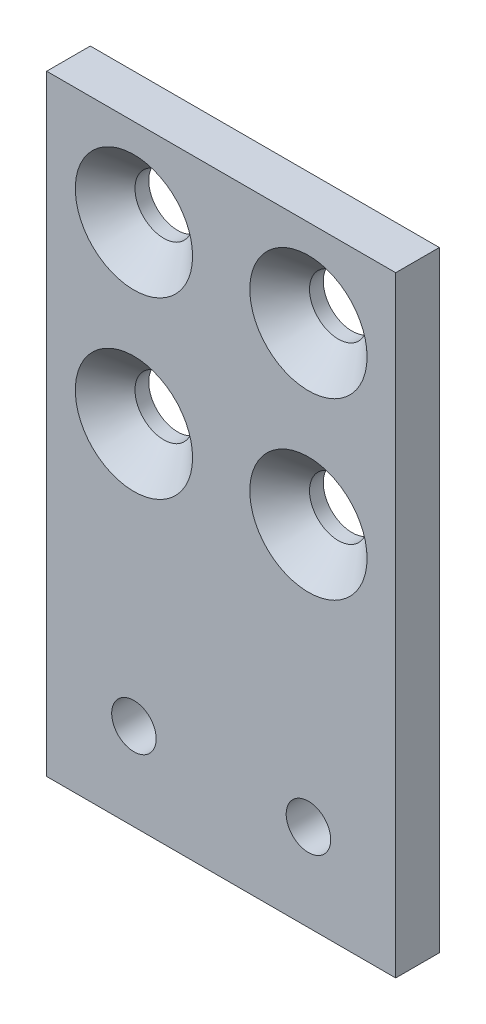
from build123d import *

# Parameters (mm, degrees)
SKETCH1_W                     = 40
SKETCH1_H                     = 70
EXTRUDE1_DEPTH                = 5
CSK_FOR_M6_SFHCS1_AT_2_COUNT  = 2
CSK_FOR_M6_SFHCS1_AT_2_PITCH  = 20
CSK_FOR_M6_SFHCS1_AT_3_COUNT  = 2
CSK_FOR_M6_SFHCS1_AT_3_PITCH  = 20
CSK_FOR_M6_SFHCS1_AT_4_COUNT  = 2
CSK_FOR_M6_SFHCS1_AT_4_PITCH  = 28.284271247
M5_1_5_1_DIAMETER_HOLE1_D     = 5.1
M5_1_5_1_DIAMETER_HOLE1_DEPTH = 10
M5_1_5_1_DIAMETER_HOLE1_TIP   = 1.532194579


with BuildPart() as part:
    # Sketch1 → Extrude1 (new body)
    with BuildSketch(Plane.XY):
        with Locations((-69.488545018, -15.95)):
            Rectangle(SKETCH1_W, SKETCH1_H)
    extrude(amount=EXTRUDE1_DEPTH)

    # Sketch2 → CSK for M6 SFHCS1 (revolve, cut)
    with BuildSketch(Plane(origin=(-59.488545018, 9.05, 5), x_dir=(0, -1, 0), z_dir=(1, 0, 0))):
        Polygon((0, 0), (0, 5), (3.3, 5), (3.3, 3.42), (6.72, 0), align=None)
    csk_for_m6_sfhcs1 = revolve(axis=Axis((-59.488545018, 9.05, 11.35), (0, 0, -1)), mode=Mode.SUBTRACT)

    # CSK for M6 SFHCS1 at 2: CSK for M6 SFHCS1 ×2
    with Locations(*[(-i * CSK_FOR_M6_SFHCS1_AT_2_PITCH, 0, 0) for i in range(1, CSK_FOR_M6_SFHCS1_AT_2_COUNT)]):
        add(csk_for_m6_sfhcs1, mode=Mode.SUBTRACT)

    # CSK for M6 SFHCS1 at 3: CSK for M6 SFHCS1 ×2
    with Locations(*[(0, -i * CSK_FOR_M6_SFHCS1_AT_3_PITCH, 0) for i in range(1, CSK_FOR_M6_SFHCS1_AT_3_COUNT)]):
        add(csk_for_m6_sfhcs1, mode=Mode.SUBTRACT)

    # CSK for M6 SFHCS1 at 4: CSK for M6 SFHCS1 ×2
    with Locations(*[Vector(-0.7071067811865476, -0.7071067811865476, 0) * (i * CSK_FOR_M6_SFHCS1_AT_4_PITCH) for i in range(1, CSK_FOR_M6_SFHCS1_AT_4_COUNT)]):
        add(csk_for_m6_sfhcs1, mode=Mode.SUBTRACT)

    # M5.1 _5.1_ Diameter Hole1
    with Locations(Plane.XY.offset(5)):
        with Locations((-79.488545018, -40.95), (-59.488545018, -40.95)):
            Hole(M5_1_5_1_DIAMETER_HOLE1_D / 2, depth=M5_1_5_1_DIAMETER_HOLE1_DEPTH)
            with Locations((0, 0, -(M5_1_5_1_DIAMETER_HOLE1_DEPTH + M5_1_5_1_DIAMETER_HOLE1_TIP / 2))):  # 118° drill point
                Cone(0, M5_1_5_1_DIAMETER_HOLE1_D / 2, M5_1_5_1_DIAMETER_HOLE1_TIP, mode=Mode.SUBTRACT)


solid = part.part
